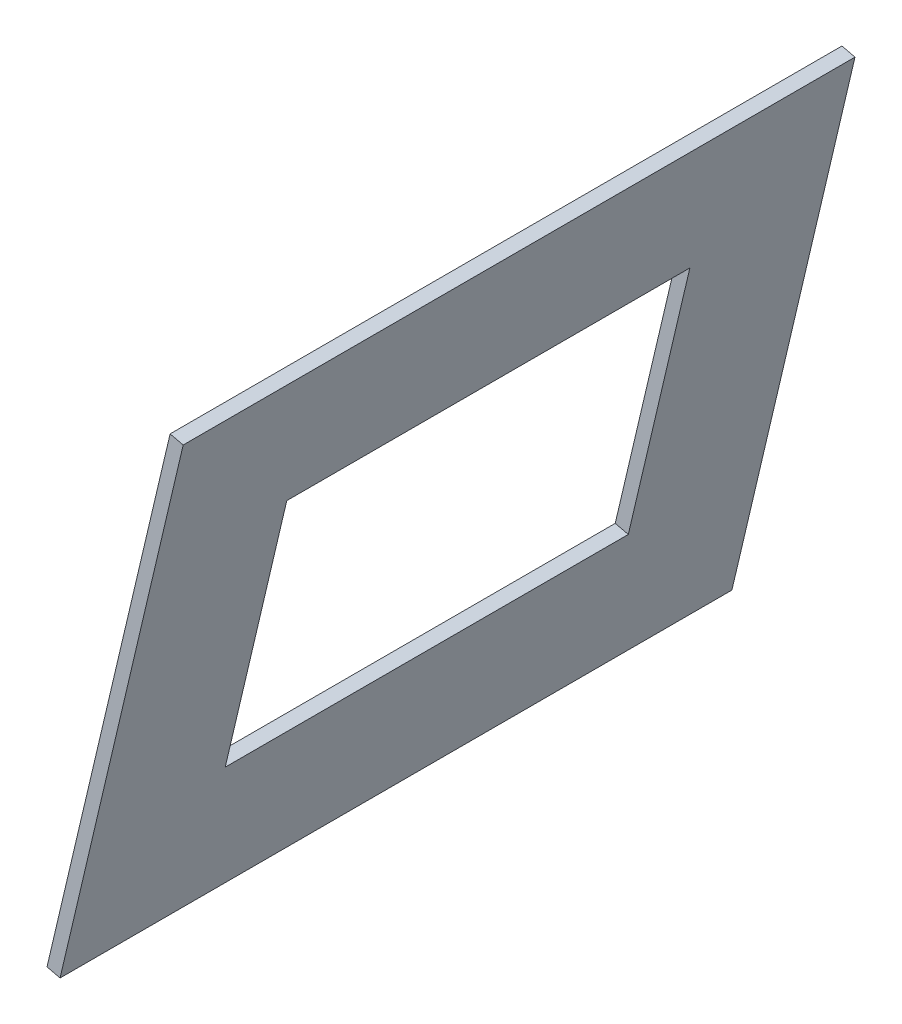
from build123d import *

# Parameters (mm, degrees)
SALIENTE_EXTRUIR1_DEPTH    = 500
CORTAR_EXTRUIR1_DEPTH      = 705.61727601
CORTAR_EXTRUIR1_DEPTH_BACK = 705.61727601
CROQUIS3_W                 = 300
CROQUIS3_H                 = 200


with BuildPart() as part:
    # Croquis1 → Saliente-Extruir1 (new body)
    with BuildSketch(Plane.XY):
        Polygon((-238.219832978, 152.785786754), (-228.485745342, 150.495036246), (-136.85572503, 539.858541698), (-146.589812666, 542.149292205), align=None)
    extrude(amount=SALIENTE_EXTRUIR1_DEPTH)

    # Croquis3 → Cortar-Extruir1 (cut, two sides: drawn at the far end of the back side and taken through both)
    with BuildSketch(Plane(origin=(-259.787891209, 61.136622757, 0), x_dir=(0, 0, 1), z_dir=(-0.9734087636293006, 0.2290750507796, 0)).offset(-CORTAR_EXTRUIR1_DEPTH_BACK)):
        with Locations((250, 294.152803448)):
            Rectangle(CROQUIS3_W, CROQUIS3_H)
    extrude(amount=CORTAR_EXTRUIR1_DEPTH + CORTAR_EXTRUIR1_DEPTH_BACK, mode=Mode.SUBTRACT)


solid = part.part
